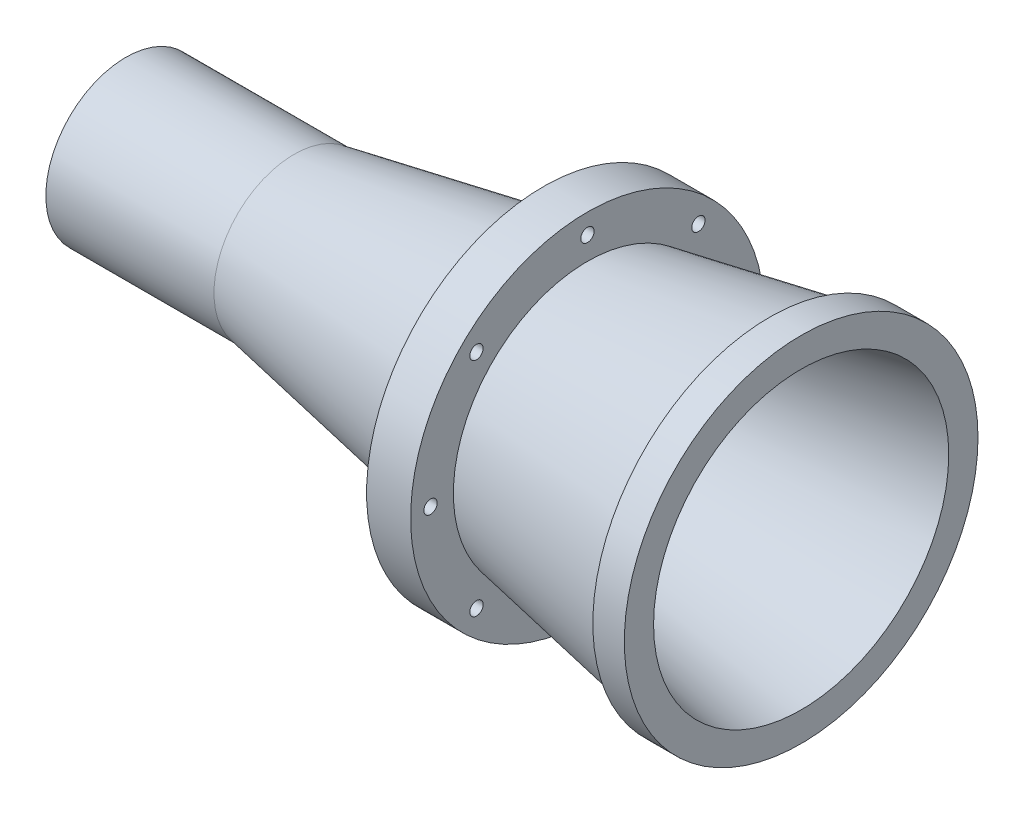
ISO-10303-21;
HEADER;
FILE_DESCRIPTION(('STEP AP214'),'2;1');
FILE_NAME('part.step','',(''),(''),'','','');
FILE_SCHEMA(('AUTOMOTIVE_DESIGN { 1 0 10303 214 1 1 1 1 }'));
ENDSEC;
DATA;
#1=APPLICATION_CONTEXT('core data for automotive mechanical design processes');
#2=APPLICATION_PROTOCOL_DEFINITION('international standard','automotive_design',2000,#1);
#3=PRODUCT_CONTEXT('',#1,'mechanical');
#4=PRODUCT('Part','Part','',(#3));
#5=PRODUCT_RELATED_PRODUCT_CATEGORY('part','',(#4));
#6=PRODUCT_DEFINITION_FORMATION('','',#4);
#7=PRODUCT_DEFINITION_CONTEXT('part definition',#1,'design');
#8=PRODUCT_DEFINITION('design','',#6,#7);
#9=PRODUCT_DEFINITION_SHAPE('','',#8);
#10=(LENGTH_UNIT() NAMED_UNIT(*) SI_UNIT(.MILLI.,.METRE.));
#11=(NAMED_UNIT(*) PLANE_ANGLE_UNIT() SI_UNIT($,.RADIAN.));
#12=(NAMED_UNIT(*) SI_UNIT($,.STERADIAN.) SOLID_ANGLE_UNIT());
#13=UNCERTAINTY_MEASURE_WITH_UNIT(LENGTH_MEASURE(1.E-05),#10,'distance_accuracy_value','');
#14=(GEOMETRIC_REPRESENTATION_CONTEXT(3) GLOBAL_UNCERTAINTY_ASSIGNED_CONTEXT((#13)) GLOBAL_UNIT_ASSIGNED_CONTEXT((#10,
#11,#12)) REPRESENTATION_CONTEXT('',''));
#15=CARTESIAN_POINT('',(0.,0.,0.));
#16=DIRECTION('',(0.,0.,1.));
#17=DIRECTION('',(1.,0.,0.));
#18=AXIS2_PLACEMENT_3D('',#15,#16,#17);
#19=CARTESIAN_POINT('',(-104.214339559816,46.5896117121,0.));
#20=DIRECTION('',(-1.,0.,0.));
#21=DIRECTION('',(0.,0.,1.));
#22=AXIS2_PLACEMENT_3D('',#19,#20,#21);
#23=PLANE('',#22);
#24=CARTESIAN_POINT('',(-104.214339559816,8.48961171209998,0.));
#25=DIRECTION('',(1.,0.,0.));
#26=DIRECTION('',(0.,0.,-1.));
#27=AXIS2_PLACEMENT_3D('',#24,#25,#26);
#28=CIRCLE('',#27,11.43);
#29=CARTESIAN_POINT('',(-104.214339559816,8.48961171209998,-11.43));
#30=VERTEX_POINT('',#29);
#31=EDGE_CURVE('E10',#30,#30,#28,.T.);
#32=ORIENTED_EDGE('',*,*,#31,.T.);
#33=EDGE_LOOP('',(#32));
#34=FACE_BOUND('',#33,.T.);
#35=CARTESIAN_POINT('',(-104.214339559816,8.48961171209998,0.));
#36=DIRECTION('',(1.,0.,0.));
#37=DIRECTION('',(0.,0.,-1.));
#38=AXIS2_PLACEMENT_3D('',#35,#36,#37);
#39=CIRCLE('',#38,38.1);
#40=CARTESIAN_POINT('',(-104.214339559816,8.48961171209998,-38.1));
#41=VERTEX_POINT('',#40);
#42=EDGE_CURVE('E69',#41,#41,#39,.T.);
#43=ORIENTED_EDGE('',*,*,#42,.F.);
#44=EDGE_LOOP('',(#43));
#45=FACE_BOUND('',#44,.T.);
#46=ADVANCED_FACE('F32',(#34,#45),#23,.T.);
#47=CARTESIAN_POINT('',(-104.214339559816,8.48961171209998,0.));
#48=DIRECTION('',(1.,0.,0.));
#49=DIRECTION('',(0.,0.,-1.));
#50=AXIS2_PLACEMENT_3D('',#47,#48,#49);
#51=CONICAL_SURFACE('',#50,11.43,0.18100108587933);
#52=CARTESIAN_POINT('',(217.095660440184,8.48961171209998,0.));
#53=DIRECTION('',(1.,0.,0.));
#54=DIRECTION('',(0.,0.,-1.));
#55=AXIS2_PLACEMENT_3D('',#52,#53,#54);
#56=CIRCLE('',#55,70.231);
#57=CARTESIAN_POINT('',(217.095660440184,8.48961171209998,-70.231));
#58=VERTEX_POINT('',#57);
#59=EDGE_CURVE('E38',#58,#58,#56,.T.);
#60=CARTESIAN_POINT('',(217.095660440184,8.48961171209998,-70.231));
#61=CARTESIAN_POINT('',(213.748681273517,8.48961171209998,-69.6184895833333));
#62=CARTESIAN_POINT('',(210.40170210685,8.48961171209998,-69.0059791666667));
#63=CARTESIAN_POINT('',(203.707743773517,8.48961171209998,-67.7809583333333));
#64=CARTESIAN_POINT('',(200.36076460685,8.48961171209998,-67.1684479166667));
#65=CARTESIAN_POINT('',(193.666806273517,8.48961171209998,-65.9434270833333));
#66=CARTESIAN_POINT('',(190.31982710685,8.48961171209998,-65.3309166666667));
#67=CARTESIAN_POINT('',(183.625868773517,8.48961171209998,-64.1058958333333));
#68=CARTESIAN_POINT('',(180.27888960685,8.48961171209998,-63.4933854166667));
#69=CARTESIAN_POINT('',(173.584931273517,8.48961171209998,-62.2683645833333));
#70=CARTESIAN_POINT('',(170.23795210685,8.48961171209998,-61.6558541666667));
#71=CARTESIAN_POINT('',(163.543993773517,8.48961171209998,-60.4308333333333));
#72=CARTESIAN_POINT('',(160.19701460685,8.48961171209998,-59.8183229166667));
#73=CARTESIAN_POINT('',(153.503056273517,8.48961171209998,-58.5933020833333));
#74=CARTESIAN_POINT('',(150.15607710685,8.48961171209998,-57.9807916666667));
#75=CARTESIAN_POINT('',(143.462118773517,8.48961171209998,-56.7557708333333));
#76=CARTESIAN_POINT('',(140.11513960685,8.48961171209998,-56.1432604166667));
#77=CARTESIAN_POINT('',(133.421181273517,8.48961171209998,-54.9182395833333));
#78=CARTESIAN_POINT('',(130.07420210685,8.48961171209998,-54.3057291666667));
#79=CARTESIAN_POINT('',(123.380243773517,8.48961171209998,-53.0807083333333));
#80=CARTESIAN_POINT('',(120.03326460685,8.48961171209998,-52.4681979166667));
#81=CARTESIAN_POINT('',(113.339306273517,8.48961171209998,-51.2431770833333));
#82=CARTESIAN_POINT('',(109.99232710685,8.48961171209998,-50.6306666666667));
#83=CARTESIAN_POINT('',(103.298368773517,8.48961171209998,-49.4056458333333));
#84=CARTESIAN_POINT('',(99.9513896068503,8.48961171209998,-48.7931354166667));
#85=CARTESIAN_POINT('',(93.257431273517,8.48961171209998,-47.5681145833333));
#86=CARTESIAN_POINT('',(89.9104521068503,8.48961171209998,-46.9556041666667));
#87=CARTESIAN_POINT('',(83.216493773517,8.48961171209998,-45.7305833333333));
#88=CARTESIAN_POINT('',(79.8695146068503,8.48961171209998,-45.1180729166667));
#89=CARTESIAN_POINT('',(73.175556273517,8.48961171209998,-43.8930520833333));
#90=CARTESIAN_POINT('',(69.8285771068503,8.48961171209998,-43.2805416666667));
#91=CARTESIAN_POINT('',(63.134618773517,8.48961171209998,-42.0555208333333));
#92=CARTESIAN_POINT('',(59.7876396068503,8.48961171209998,-41.4430104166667));
#93=CARTESIAN_POINT('',(53.093681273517,8.48961171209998,-40.2179895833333));
#94=CARTESIAN_POINT('',(49.7467021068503,8.48961171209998,-39.6054791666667));
#95=CARTESIAN_POINT('',(43.052743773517,8.48961171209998,-38.3804583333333));
#96=CARTESIAN_POINT('',(39.7057646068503,8.48961171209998,-37.7679479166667));
#97=CARTESIAN_POINT('',(33.011806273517,8.48961171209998,-36.5429270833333));
#98=CARTESIAN_POINT('',(29.6648271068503,8.48961171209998,-35.9304166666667));
#99=CARTESIAN_POINT('',(22.970868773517,8.48961171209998,-34.7053958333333));
#100=CARTESIAN_POINT('',(19.6238896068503,8.48961171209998,-34.0928854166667));
#101=CARTESIAN_POINT('',(12.929931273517,8.48961171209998,-32.8678645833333));
#102=CARTESIAN_POINT('',(9.5829521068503,8.48961171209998,-32.2553541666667));
#103=CARTESIAN_POINT('',(2.88899377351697,8.48961171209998,-31.0303333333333));
#104=CARTESIAN_POINT('',(-0.457985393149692,8.48961171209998,-30.4178229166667));
#105=CARTESIAN_POINT('',(-7.15194372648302,8.48961171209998,-29.1928020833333));
#106=CARTESIAN_POINT('',(-10.4989228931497,8.48961171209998,-28.5802916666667));
#107=CARTESIAN_POINT('',(-17.192881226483,8.48961171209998,-27.3552708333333));
#108=CARTESIAN_POINT('',(-20.5398603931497,8.48961171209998,-26.7427604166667));
#109=CARTESIAN_POINT('',(-27.233818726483,8.48961171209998,-25.5177395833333));
#110=CARTESIAN_POINT('',(-30.5807978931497,8.48961171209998,-24.9052291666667));
#111=CARTESIAN_POINT('',(-37.274756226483,8.48961171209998,-23.6802083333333));
#112=CARTESIAN_POINT('',(-40.6217353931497,8.48961171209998,-23.0676979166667));
#113=CARTESIAN_POINT('',(-47.315693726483,8.48961171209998,-21.8426770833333));
#114=CARTESIAN_POINT('',(-50.6626728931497,8.48961171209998,-21.2301666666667));
#115=CARTESIAN_POINT('',(-57.356631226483,8.48961171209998,-20.0051458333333));
#116=CARTESIAN_POINT('',(-60.7036103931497,8.48961171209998,-19.3926354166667));
#117=CARTESIAN_POINT('',(-67.397568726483,8.48961171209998,-18.1676145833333));
#118=CARTESIAN_POINT('',(-70.7445478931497,8.48961171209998,-17.5551041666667));
#119=CARTESIAN_POINT('',(-77.438506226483,8.48961171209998,-16.3300833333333));
#120=CARTESIAN_POINT('',(-80.7854853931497,8.48961171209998,-15.7175729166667));
#121=CARTESIAN_POINT('',(-87.479443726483,8.48961171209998,-14.4925520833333));
#122=CARTESIAN_POINT('',(-90.8264228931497,8.48961171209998,-13.8800416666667));
#123=CARTESIAN_POINT('',(-97.520381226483,8.48961171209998,-12.6550208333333));
#124=CARTESIAN_POINT('',(-100.86736039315,8.48961171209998,-12.0425104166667));
#125=CARTESIAN_POINT('',(-104.214339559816,8.48961171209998,-11.43));
#126=B_SPLINE_CURVE_WITH_KNOTS('',3,(#60,#61,#62,#63,#64,#65,#66,#67,#68,#69,#70,#71,#72,#73,
#74,#75,#76,#77,#78,#79,#80,#81,#82,#83,#84,#85,#86,#87,#88,#89,#90,#91,#92,#93,#94,#95,#96,#97,
#98,#99,#100,#101,#102,#103,#104,#105,#106,#107,#108,#109,#110,#111,#112,#113,#114,#115,#116,
#117,#118,#119,#120,#121,#122,#123,#124,#125),.UNSPECIFIED.,.F.,.F.,(4,2,2,2,2,2,2,2,2,2,2,2,2,
2,2,2,2,2,2,2,2,2,2,2,2,2,2,2,2,2,2,2,4),(0.,10.2076905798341,20.4153811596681,30.6230717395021,
40.8307623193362,51.0384528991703,61.2461434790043,71.4538340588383,81.6615246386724,
91.8692152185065,102.076905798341,112.284596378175,122.492286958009,132.699977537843,
142.907668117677,153.115358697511,163.323049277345,173.530739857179,183.738430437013,
193.946121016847,204.153811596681,214.361502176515,224.569192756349,234.776883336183,
244.984573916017,255.192264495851,265.399955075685,275.607645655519,285.815336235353,
296.023026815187,306.230717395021,316.438407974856,326.64609855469),.UNSPECIFIED.);
#127=EDGE_CURVE('BSEAM181',#58,#30,#126,.T.);
#128=ORIENTED_EDGE('',*,*,#59,.T.);
#129=ORIENTED_EDGE('',*,*,#31,.F.);
#130=ORIENTED_EDGE('',*,*,#127,.T.);
#131=ORIENTED_EDGE('',*,*,#127,.F.);
#132=EDGE_LOOP('',(#128,#130,#129,#131));
#133=FACE_BOUND('',#132,.T.);
#134=ADVANCED_FACE('F181',(#133),#51,.F.);
#135=CARTESIAN_POINT('',(217.095660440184,92.6398117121,0.));
#136=DIRECTION('',(1.,0.,0.));
#137=DIRECTION('',(0.,0.,-1.));
#138=AXIS2_PLACEMENT_3D('',#135,#136,#137);
#139=PLANE('',#138);
#140=CARTESIAN_POINT('',(217.095660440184,8.48961171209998,0.));
#141=DIRECTION('',(1.,0.,0.));
#142=DIRECTION('',(0.,0.,-1.));
#143=AXIS2_PLACEMENT_3D('',#140,#141,#142);
#144=CIRCLE('',#143,84.1502);
#145=CARTESIAN_POINT('',(217.095660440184,8.48961171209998,-84.1502));
#146=VERTEX_POINT('',#145);
#147=EDGE_CURVE('E42',#146,#146,#144,.T.);
#148=ORIENTED_EDGE('',*,*,#147,.T.);
#149=EDGE_LOOP('',(#148));
#150=FACE_BOUND('',#149,.T.);
#151=ORIENTED_EDGE('',*,*,#59,.F.);
#152=EDGE_LOOP('',(#151));
#153=FACE_BOUND('',#152,.T.);
#154=ADVANCED_FACE('F175',(#150,#153),#139,.T.);
#155=CARTESIAN_POINT('',(217.095660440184,8.48961171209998,0.));
#156=DIRECTION('',(1.,0.,0.));
#157=DIRECTION('',(0.,0.,-1.));
#158=AXIS2_PLACEMENT_3D('',#155,#156,#157);
#159=CYLINDRICAL_SURFACE('',#158,84.1502);
#160=CARTESIAN_POINT('',(202.109660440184,8.48961171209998,0.));
#161=DIRECTION('',(1.,0.,0.));
#162=DIRECTION('',(0.,0.,-1.));
#163=AXIS2_PLACEMENT_3D('',#160,#161,#162);
#164=CIRCLE('',#163,84.1502);
#165=CARTESIAN_POINT('',(202.109660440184,8.48961171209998,-84.1502));
#166=VERTEX_POINT('',#165);
#167=EDGE_CURVE('E46',#166,#166,#164,.T.);
#168=ORIENTED_EDGE('',*,*,#167,.T.);
#169=EDGE_LOOP('',(#168));
#170=FACE_BOUND('',#169,.T.);
#171=ORIENTED_EDGE('',*,*,#147,.F.);
#172=EDGE_LOOP('',(#171));
#173=FACE_BOUND('',#172,.T.);
#174=ADVANCED_FACE('F169',(#170,#173),#159,.T.);
#175=CARTESIAN_POINT('',(202.109660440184,88.2524850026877,0.));
#176=DIRECTION('',(-1.,0.,0.));
#177=DIRECTION('',(0.,0.,1.));
#178=AXIS2_PLACEMENT_3D('',#175,#176,#177);
#179=PLANE('',#178);
#180=CARTESIAN_POINT('',(202.109660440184,8.48961171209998,0.));
#181=DIRECTION('',(1.,0.,0.));
#182=DIRECTION('',(0.,0.,-1.));
#183=AXIS2_PLACEMENT_3D('',#180,#181,#182);
#184=CIRCLE('',#183,79.7628732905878);
#185=CARTESIAN_POINT('',(202.109660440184,8.48961171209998,-79.7628732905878));
#186=VERTEX_POINT('',#185);
#187=EDGE_CURVE('E51',#186,#186,#184,.T.);
#188=ORIENTED_EDGE('',*,*,#187,.T.);
#189=EDGE_LOOP('',(#188));
#190=FACE_BOUND('',#189,.T.);
#191=ORIENTED_EDGE('',*,*,#167,.F.);
#192=EDGE_LOOP('',(#191));
#193=FACE_BOUND('',#192,.T.);
#194=ADVANCED_FACE('F163',(#190,#193),#179,.T.);
#195=CARTESIAN_POINT('',(202.109660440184,8.48961171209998,0.));
#196=DIRECTION('',(1.,0.,0.));
#197=DIRECTION('',(0.,0.,-1.));
#198=AXIS2_PLACEMENT_3D('',#195,#196,#197);
#199=CONICAL_SURFACE('',#198,79.7628732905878,0.182054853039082);
#200=CARTESIAN_POINT('',(115.407935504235,8.48961171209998,0.));
#201=DIRECTION('',(1.,0.,0.));
#202=DIRECTION('',(0.,0.,-1.));
#203=AXIS2_PLACEMENT_3D('',#200,#201,#202);
#204=CIRCLE('',#203,63.8016734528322);
#205=CARTESIAN_POINT('',(115.407935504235,8.48961171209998,-63.8016734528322));
#206=VERTEX_POINT('',#205);
#207=EDGE_CURVE('E54',#206,#206,#204,.T.);
#208=ORIENTED_EDGE('',*,*,#207,.T.);
#209=EDGE_LOOP('',(#208));
#210=FACE_BOUND('',#209,.T.);
#211=ORIENTED_EDGE('',*,*,#187,.F.);
#212=EDGE_LOOP('',(#211));
#213=FACE_BOUND('',#212,.T.);
#214=ADVANCED_FACE('F156',(#210,#213),#199,.T.);
#215=CARTESIAN_POINT('',(115.407935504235,92.6398117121,0.));
#216=DIRECTION('',(1.,0.,0.));
#217=DIRECTION('',(0.,0.,-1.));
#218=AXIS2_PLACEMENT_3D('',#215,#216,#217);
#219=PLANE('',#218);
#220=CARTESIAN_POINT('',(115.407935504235,61.2935177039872,-52.803905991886));
#221=DIRECTION('',(1.,0.,0.));
#222=DIRECTION('',(0.,0.,-1.));
#223=AXIS2_PLACEMENT_3D('',#220,#221,#222);
#224=CIRCLE('',#223,3.17499999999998);
#225=CARTESIAN_POINT('',(115.407935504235,61.2935177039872,-55.978905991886));
#226=VERTEX_POINT('',#225);
#227=EDGE_CURVE('E114',#226,#226,#224,.T.);
#228=ORIENTED_EDGE('',*,*,#227,.F.);
#229=EDGE_LOOP('',(#228));
#230=FACE_BOUND('',#229,.T.);
#231=CARTESIAN_POINT('',(115.407935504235,8.48961171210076,-74.676));
#232=DIRECTION('',(1.,0.,0.));
#233=DIRECTION('',(0.,0.,-1.));
#234=AXIS2_PLACEMENT_3D('',#231,#232,#233);
#235=CIRCLE('',#234,3.17499999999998);
#236=CARTESIAN_POINT('',(115.407935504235,8.48961171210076,-77.851));
#237=VERTEX_POINT('',#236);
#238=EDGE_CURVE('E108',#237,#237,#235,.T.);
#239=ORIENTED_EDGE('',*,*,#238,.F.);
#240=EDGE_LOOP('',(#239));
#241=FACE_BOUND('',#240,.T.);
#242=CARTESIAN_POINT('',(115.407935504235,-44.3142942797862,-52.8039059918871));
#243=DIRECTION('',(1.,0.,0.));
#244=DIRECTION('',(0.,0.,-1.));
#245=AXIS2_PLACEMENT_3D('',#242,#243,#244);
#246=CIRCLE('',#245,3.17499999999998);
#247=CARTESIAN_POINT('',(115.407935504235,-44.3142942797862,-55.9789059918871));
#248=VERTEX_POINT('',#247);
#249=EDGE_CURVE('E102',#248,#248,#246,.T.);
#250=ORIENTED_EDGE('',*,*,#249,.F.);
#251=EDGE_LOOP('',(#250));
#252=FACE_BOUND('',#251,.T.);
#253=CARTESIAN_POINT('',(115.407935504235,-66.1863882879,0.));
#254=DIRECTION('',(1.,0.,0.));
#255=DIRECTION('',(0.,0.,-1.));
#256=AXIS2_PLACEMENT_3D('',#253,#254,#255);
#257=CIRCLE('',#256,3.17499999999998);
#258=CARTESIAN_POINT('',(115.407935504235,-66.1863882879,-3.17499999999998));
#259=VERTEX_POINT('',#258);
#260=EDGE_CURVE('E96',#259,#259,#257,.T.);
#261=ORIENTED_EDGE('',*,*,#260,.F.);
#262=EDGE_LOOP('',(#261));
#263=FACE_BOUND('',#262,.T.);
#264=CARTESIAN_POINT('',(115.407935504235,-44.3142942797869,52.8039059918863));
#265=DIRECTION('',(1.,0.,0.));
#266=DIRECTION('',(0.,0.,-1.));
#267=AXIS2_PLACEMENT_3D('',#264,#265,#266);
#268=CIRCLE('',#267,3.17499999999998);
#269=CARTESIAN_POINT('',(115.407935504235,-44.3142942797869,49.6289059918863));
#270=VERTEX_POINT('',#269);
#271=EDGE_CURVE('E90',#270,#270,#268,.T.);
#272=ORIENTED_EDGE('',*,*,#271,.F.);
#273=EDGE_LOOP('',(#272));
#274=FACE_BOUND('',#273,.T.);
#275=CARTESIAN_POINT('',(115.407935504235,8.48961171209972,74.676));
#276=DIRECTION('',(1.,0.,0.));
#277=DIRECTION('',(0.,0.,-1.));
#278=AXIS2_PLACEMENT_3D('',#275,#276,#277);
#279=CIRCLE('',#278,3.17499999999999);
#280=CARTESIAN_POINT('',(115.407935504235,8.48961171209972,71.501));
#281=VERTEX_POINT('',#280);
#282=EDGE_CURVE('E84',#281,#281,#279,.T.);
#283=ORIENTED_EDGE('',*,*,#282,.F.);
#284=EDGE_LOOP('',(#283));
#285=FACE_BOUND('',#284,.T.);
#286=CARTESIAN_POINT('',(115.407935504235,61.2935177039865,52.8039059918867));
#287=DIRECTION('',(1.,0.,0.));
#288=DIRECTION('',(0.,0.,-1.));
#289=AXIS2_PLACEMENT_3D('',#286,#287,#288);
#290=CIRCLE('',#289,3.17499999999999);
#291=CARTESIAN_POINT('',(115.407935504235,61.2935177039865,49.6289059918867));
#292=VERTEX_POINT('',#291);
#293=EDGE_CURVE('E78',#292,#292,#290,.T.);
#294=ORIENTED_EDGE('',*,*,#293,.F.);
#295=EDGE_LOOP('',(#294));
#296=FACE_BOUND('',#295,.T.);
#297=CARTESIAN_POINT('',(115.407935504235,83.1656117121,0.));
#298=DIRECTION('',(1.,0.,0.));
#299=DIRECTION('',(0.,0.,-1.));
#300=AXIS2_PLACEMENT_3D('',#297,#298,#299);
#301=CIRCLE('',#300,3.17499999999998);
#302=CARTESIAN_POINT('',(115.407935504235,83.1656117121,-3.17499999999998));
#303=VERTEX_POINT('',#302);
#304=EDGE_CURVE('E72',#303,#303,#301,.T.);
#305=ORIENTED_EDGE('',*,*,#304,.F.);
#306=EDGE_LOOP('',(#305));
#307=FACE_BOUND('',#306,.T.);
#308=CARTESIAN_POINT('',(115.407935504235,8.48961171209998,0.));
#309=DIRECTION('',(1.,0.,0.));
#310=DIRECTION('',(0.,0.,-1.));
#311=AXIS2_PLACEMENT_3D('',#308,#309,#310);
#312=CIRCLE('',#311,84.1502);
#313=CARTESIAN_POINT('',(115.407935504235,8.48961171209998,-84.1502));
#314=VERTEX_POINT('',#313);
#315=EDGE_CURVE('E57',#314,#314,#312,.T.);
#316=ORIENTED_EDGE('',*,*,#315,.T.);
#317=EDGE_LOOP('',(#316));
#318=FACE_BOUND('',#317,.T.);
#319=ORIENTED_EDGE('',*,*,#207,.F.);
#320=EDGE_LOOP('',(#319));
#321=FACE_BOUND('',#320,.T.);
#322=ADVANCED_FACE('F150',(#230,#241,#252,#263,#274,#285,#296,#307,#318,#321),#219,.T.);
#323=CARTESIAN_POINT('',(217.095660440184,8.48961171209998,0.));
#324=DIRECTION('',(1.,0.,0.));
#325=DIRECTION('',(0.,0.,-1.));
#326=AXIS2_PLACEMENT_3D('',#323,#324,#325);
#327=CYLINDRICAL_SURFACE('',#326,84.1502);
#328=CARTESIAN_POINT('',(94.4529355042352,8.48961171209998,0.));
#329=DIRECTION('',(1.,0.,0.));
#330=DIRECTION('',(0.,0.,-1.));
#331=AXIS2_PLACEMENT_3D('',#328,#329,#330);
#332=CIRCLE('',#331,84.1502);
#333=CARTESIAN_POINT('',(94.4529355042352,8.48961171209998,-84.1502));
#334=VERTEX_POINT('',#333);
#335=EDGE_CURVE('E60',#334,#334,#332,.T.);
#336=ORIENTED_EDGE('',*,*,#335,.T.);
#337=EDGE_LOOP('',(#336));
#338=FACE_BOUND('',#337,.T.);
#339=ORIENTED_EDGE('',*,*,#315,.F.);
#340=EDGE_LOOP('',(#339));
#341=FACE_BOUND('',#340,.T.);
#342=ADVANCED_FACE('F128',(#338,#341),#327,.T.);
#343=CARTESIAN_POINT('',(94.4529355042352,92.6398117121,0.));
#344=DIRECTION('',(-1.,0.,0.));
#345=DIRECTION('',(0.,0.,1.));
#346=AXIS2_PLACEMENT_3D('',#343,#344,#345);
#347=PLANE('',#346);
#348=CARTESIAN_POINT('',(94.4529355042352,61.2935177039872,-52.803905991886));
#349=DIRECTION('',(-1.,0.,0.));
#350=DIRECTION('',(0.,0.,1.));
#351=AXIS2_PLACEMENT_3D('',#348,#349,#350);
#352=CIRCLE('',#351,3.17499999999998);
#353=CARTESIAN_POINT('',(94.4529355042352,61.2935177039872,-49.628905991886));
#354=VERTEX_POINT('',#353);
#355=EDGE_CURVE('E117',#354,#354,#352,.T.);
#356=ORIENTED_EDGE('',*,*,#355,.F.);
#357=EDGE_LOOP('',(#356));
#358=FACE_BOUND('',#357,.T.);
#359=CARTESIAN_POINT('',(94.4529355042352,8.48961171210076,-74.676));
#360=DIRECTION('',(-1.,0.,0.));
#361=DIRECTION('',(0.,0.,1.));
#362=AXIS2_PLACEMENT_3D('',#359,#360,#361);
#363=CIRCLE('',#362,3.17499999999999);
#364=CARTESIAN_POINT('',(94.4529355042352,8.48961171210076,-71.501));
#365=VERTEX_POINT('',#364);
#366=EDGE_CURVE('E111',#365,#365,#363,.T.);
#367=ORIENTED_EDGE('',*,*,#366,.F.);
#368=EDGE_LOOP('',(#367));
#369=FACE_BOUND('',#368,.T.);
#370=CARTESIAN_POINT('',(94.4529355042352,-44.3142942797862,-52.8039059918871));
#371=DIRECTION('',(-1.,0.,0.));
#372=DIRECTION('',(0.,0.,1.));
#373=AXIS2_PLACEMENT_3D('',#370,#371,#372);
#374=CIRCLE('',#373,3.17499999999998);
#375=CARTESIAN_POINT('',(94.4529355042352,-44.3142942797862,-49.6289059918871));
#376=VERTEX_POINT('',#375);
#377=EDGE_CURVE('E105',#376,#376,#374,.T.);
#378=ORIENTED_EDGE('',*,*,#377,.F.);
#379=EDGE_LOOP('',(#378));
#380=FACE_BOUND('',#379,.T.);
#381=CARTESIAN_POINT('',(94.4529355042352,-66.1863882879,0.));
#382=DIRECTION('',(-1.,0.,0.));
#383=DIRECTION('',(0.,0.,1.));
#384=AXIS2_PLACEMENT_3D('',#381,#382,#383);
#385=CIRCLE('',#384,3.17499999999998);
#386=CARTESIAN_POINT('',(94.4529355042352,-66.1863882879,3.17499999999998));
#387=VERTEX_POINT('',#386);
#388=EDGE_CURVE('E99',#387,#387,#385,.T.);
#389=ORIENTED_EDGE('',*,*,#388,.F.);
#390=EDGE_LOOP('',(#389));
#391=FACE_BOUND('',#390,.T.);
#392=CARTESIAN_POINT('',(94.4529355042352,-44.3142942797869,52.8039059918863));
#393=DIRECTION('',(-1.,0.,0.));
#394=DIRECTION('',(0.,0.,1.));
#395=AXIS2_PLACEMENT_3D('',#392,#393,#394);
#396=CIRCLE('',#395,3.17499999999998);
#397=CARTESIAN_POINT('',(94.4529355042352,-44.3142942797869,55.9789059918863));
#398=VERTEX_POINT('',#397);
#399=EDGE_CURVE('E93',#398,#398,#396,.T.);
#400=ORIENTED_EDGE('',*,*,#399,.F.);
#401=EDGE_LOOP('',(#400));
#402=FACE_BOUND('',#401,.T.);
#403=CARTESIAN_POINT('',(94.4529355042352,8.48961171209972,74.676));
#404=DIRECTION('',(-1.,0.,0.));
#405=DIRECTION('',(0.,0.,1.));
#406=AXIS2_PLACEMENT_3D('',#403,#404,#405);
#407=CIRCLE('',#406,3.17499999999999);
#408=CARTESIAN_POINT('',(94.4529355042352,8.48961171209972,77.851));
#409=VERTEX_POINT('',#408);
#410=EDGE_CURVE('E87',#409,#409,#407,.T.);
#411=ORIENTED_EDGE('',*,*,#410,.F.);
#412=EDGE_LOOP('',(#411));
#413=FACE_BOUND('',#412,.T.);
#414=CARTESIAN_POINT('',(94.4529355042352,61.2935177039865,52.8039059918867));
#415=DIRECTION('',(-1.,0.,0.));
#416=DIRECTION('',(0.,0.,1.));
#417=AXIS2_PLACEMENT_3D('',#414,#415,#416);
#418=CIRCLE('',#417,3.17499999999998);
#419=CARTESIAN_POINT('',(94.4529355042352,61.2935177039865,55.9789059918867));
#420=VERTEX_POINT('',#419);
#421=EDGE_CURVE('E81',#420,#420,#418,.T.);
#422=ORIENTED_EDGE('',*,*,#421,.F.);
#423=EDGE_LOOP('',(#422));
#424=FACE_BOUND('',#423,.T.);
#425=CARTESIAN_POINT('',(94.4529355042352,83.1656117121,0.));
#426=DIRECTION('',(-1.,0.,0.));
#427=DIRECTION('',(0.,0.,1.));
#428=AXIS2_PLACEMENT_3D('',#425,#426,#427);
#429=CIRCLE('',#428,3.17499999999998);
#430=CARTESIAN_POINT('',(94.4529355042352,83.1656117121,3.17499999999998));
#431=VERTEX_POINT('',#430);
#432=EDGE_CURVE('E75',#431,#431,#429,.T.);
#433=ORIENTED_EDGE('',*,*,#432,.F.);
#434=EDGE_LOOP('',(#433));
#435=FACE_BOUND('',#434,.T.);
#436=CARTESIAN_POINT('',(94.4529355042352,8.48961171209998,0.));
#437=DIRECTION('',(1.,0.,0.));
#438=DIRECTION('',(0.,0.,-1.));
#439=AXIS2_PLACEMENT_3D('',#436,#437,#438);
#440=CIRCLE('',#439,59.944);
#441=CARTESIAN_POINT('',(94.4529355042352,8.48961171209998,-59.944));
#442=VERTEX_POINT('',#441);
#443=EDGE_CURVE('E63',#442,#442,#440,.T.);
#444=ORIENTED_EDGE('',*,*,#443,.T.);
#445=EDGE_LOOP('',(#444));
#446=FACE_BOUND('',#445,.T.);
#447=ORIENTED_EDGE('',*,*,#335,.F.);
#448=EDGE_LOOP('',(#447));
#449=FACE_BOUND('',#448,.T.);
#450=ADVANCED_FACE('F124',(#358,#369,#380,#391,#402,#413,#424,#435,#446,#449),#347,.T.);
#451=CARTESIAN_POINT('',(94.4529355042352,8.48961171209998,0.));
#452=DIRECTION('',(1.,0.,0.));
#453=DIRECTION('',(0.,0.,-1.));
#454=AXIS2_PLACEMENT_3D('',#451,#452,#453);
#455=CONICAL_SURFACE('',#454,59.944,0.182054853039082);
#456=CARTESIAN_POINT('',(-24.2043395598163,8.48961171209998,0.));
#457=DIRECTION('',(1.,0.,0.));
#458=DIRECTION('',(0.,0.,-1.));
#459=AXIS2_PLACEMENT_3D('',#456,#457,#458);
#460=CIRCLE('',#459,38.1);
#461=CARTESIAN_POINT('',(-24.2043395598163,8.48961171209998,-38.1));
#462=VERTEX_POINT('',#461);
#463=EDGE_CURVE('E66',#462,#462,#460,.T.);
#464=ORIENTED_EDGE('',*,*,#463,.T.);
#465=EDGE_LOOP('',(#464));
#466=FACE_BOUND('',#465,.T.);
#467=ORIENTED_EDGE('',*,*,#443,.F.);
#468=EDGE_LOOP('',(#467));
#469=FACE_BOUND('',#468,.T.);
#470=ADVANCED_FACE('F127',(#466,#469),#455,.T.);
#471=CARTESIAN_POINT('',(217.095660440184,8.48961171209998,0.));
#472=DIRECTION('',(1.,0.,0.));
#473=DIRECTION('',(0.,0.,-1.));
#474=AXIS2_PLACEMENT_3D('',#471,#472,#473);
#475=CYLINDRICAL_SURFACE('',#474,38.1);
#476=ORIENTED_EDGE('',*,*,#42,.T.);
#477=EDGE_LOOP('',(#476));
#478=FACE_BOUND('',#477,.T.);
#479=ORIENTED_EDGE('',*,*,#463,.F.);
#480=EDGE_LOOP('',(#479));
#481=FACE_BOUND('',#480,.T.);
#482=ADVANCED_FACE('F192',(#478,#481),#475,.T.);
#483=CARTESIAN_POINT('',(94.4529355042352,83.1656117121,0.));
#484=DIRECTION('',(-1.,0.,0.));
#485=DIRECTION('',(0.,0.,1.));
#486=AXIS2_PLACEMENT_3D('',#483,#484,#485);
#487=CYLINDRICAL_SURFACE('',#486,3.17499999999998);
#488=ORIENTED_EDGE('',*,*,#432,.T.);
#489=EDGE_LOOP('',(#488));
#490=FACE_BOUND('',#489,.T.);
#491=ORIENTED_EDGE('',*,*,#304,.T.);
#492=EDGE_LOOP('',(#491));
#493=FACE_BOUND('',#492,.T.);
#494=ADVANCED_FACE('F195',(#490,#493),#487,.F.);
#495=CARTESIAN_POINT('',(94.4529355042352,61.2935177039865,52.8039059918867));
#496=DIRECTION('',(-1.,0.,0.));
#497=DIRECTION('',(0.,0.,1.));
#498=AXIS2_PLACEMENT_3D('',#495,#496,#497);
#499=CYLINDRICAL_SURFACE('',#498,3.17499999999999);
#500=ORIENTED_EDGE('',*,*,#421,.T.);
#501=EDGE_LOOP('',(#500));
#502=FACE_BOUND('',#501,.T.);
#503=ORIENTED_EDGE('',*,*,#293,.T.);
#504=EDGE_LOOP('',(#503));
#505=FACE_BOUND('',#504,.T.);
#506=ADVANCED_FACE('F207',(#502,#505),#499,.F.);
#507=CARTESIAN_POINT('',(94.4529355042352,8.48961171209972,74.676));
#508=DIRECTION('',(-1.,0.,0.));
#509=DIRECTION('',(0.,0.,1.));
#510=AXIS2_PLACEMENT_3D('',#507,#508,#509);
#511=CYLINDRICAL_SURFACE('',#510,3.17499999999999);
#512=ORIENTED_EDGE('',*,*,#410,.T.);
#513=EDGE_LOOP('',(#512));
#514=FACE_BOUND('',#513,.T.);
#515=ORIENTED_EDGE('',*,*,#282,.T.);
#516=EDGE_LOOP('',(#515));
#517=FACE_BOUND('',#516,.T.);
#518=ADVANCED_FACE('F211',(#514,#517),#511,.F.);
#519=CARTESIAN_POINT('',(94.4529355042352,-44.3142942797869,52.8039059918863));
#520=DIRECTION('',(-1.,0.,0.));
#521=DIRECTION('',(0.,0.,1.));
#522=AXIS2_PLACEMENT_3D('',#519,#520,#521);
#523=CYLINDRICAL_SURFACE('',#522,3.17499999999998);
#524=ORIENTED_EDGE('',*,*,#399,.T.);
#525=EDGE_LOOP('',(#524));
#526=FACE_BOUND('',#525,.T.);
#527=ORIENTED_EDGE('',*,*,#271,.T.);
#528=EDGE_LOOP('',(#527));
#529=FACE_BOUND('',#528,.T.);
#530=ADVANCED_FACE('F215',(#526,#529),#523,.F.);
#531=CARTESIAN_POINT('',(94.4529355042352,-66.1863882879,0.));
#532=DIRECTION('',(-1.,0.,0.));
#533=DIRECTION('',(0.,0.,1.));
#534=AXIS2_PLACEMENT_3D('',#531,#532,#533);
#535=CYLINDRICAL_SURFACE('',#534,3.17499999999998);
#536=ORIENTED_EDGE('',*,*,#388,.T.);
#537=EDGE_LOOP('',(#536));
#538=FACE_BOUND('',#537,.T.);
#539=ORIENTED_EDGE('',*,*,#260,.T.);
#540=EDGE_LOOP('',(#539));
#541=FACE_BOUND('',#540,.T.);
#542=ADVANCED_FACE('F219',(#538,#541),#535,.F.);
#543=CARTESIAN_POINT('',(94.4529355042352,-44.3142942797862,-52.8039059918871));
#544=DIRECTION('',(-1.,0.,0.));
#545=DIRECTION('',(0.,0.,1.));
#546=AXIS2_PLACEMENT_3D('',#543,#544,#545);
#547=CYLINDRICAL_SURFACE('',#546,3.17499999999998);
#548=ORIENTED_EDGE('',*,*,#377,.T.);
#549=EDGE_LOOP('',(#548));
#550=FACE_BOUND('',#549,.T.);
#551=ORIENTED_EDGE('',*,*,#249,.T.);
#552=EDGE_LOOP('',(#551));
#553=FACE_BOUND('',#552,.T.);
#554=ADVANCED_FACE('F223',(#550,#553),#547,.F.);
#555=CARTESIAN_POINT('',(94.4529355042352,8.48961171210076,-74.676));
#556=DIRECTION('',(-1.,0.,0.));
#557=DIRECTION('',(0.,0.,1.));
#558=AXIS2_PLACEMENT_3D('',#555,#556,#557);
#559=CYLINDRICAL_SURFACE('',#558,3.17499999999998);
#560=ORIENTED_EDGE('',*,*,#366,.T.);
#561=EDGE_LOOP('',(#560));
#562=FACE_BOUND('',#561,.T.);
#563=ORIENTED_EDGE('',*,*,#238,.T.);
#564=EDGE_LOOP('',(#563));
#565=FACE_BOUND('',#564,.T.);
#566=ADVANCED_FACE('F227',(#562,#565),#559,.F.);
#567=CARTESIAN_POINT('',(94.4529355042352,61.2935177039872,-52.803905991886));
#568=DIRECTION('',(-1.,0.,0.));
#569=DIRECTION('',(0.,0.,1.));
#570=AXIS2_PLACEMENT_3D('',#567,#568,#569);
#571=CYLINDRICAL_SURFACE('',#570,3.17499999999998);
#572=ORIENTED_EDGE('',*,*,#355,.T.);
#573=EDGE_LOOP('',(#572));
#574=FACE_BOUND('',#573,.T.);
#575=ORIENTED_EDGE('',*,*,#227,.T.);
#576=EDGE_LOOP('',(#575));
#577=FACE_BOUND('',#576,.T.);
#578=ADVANCED_FACE('F121',(#574,#577),#571,.F.);
#579=CLOSED_SHELL('',(#46,#134,#154,#174,#194,#214,#322,#342,#450,#470,#482,#494,#506,#518,#530,
#542,#554,#566,#578));
#580=MANIFOLD_SOLID_BREP('B2',#579);
#581=ADVANCED_BREP_SHAPE_REPRESENTATION('',(#18,#580),#14);
#582=SHAPE_DEFINITION_REPRESENTATION(#9,#581);
ENDSEC;
END-ISO-10303-21;
